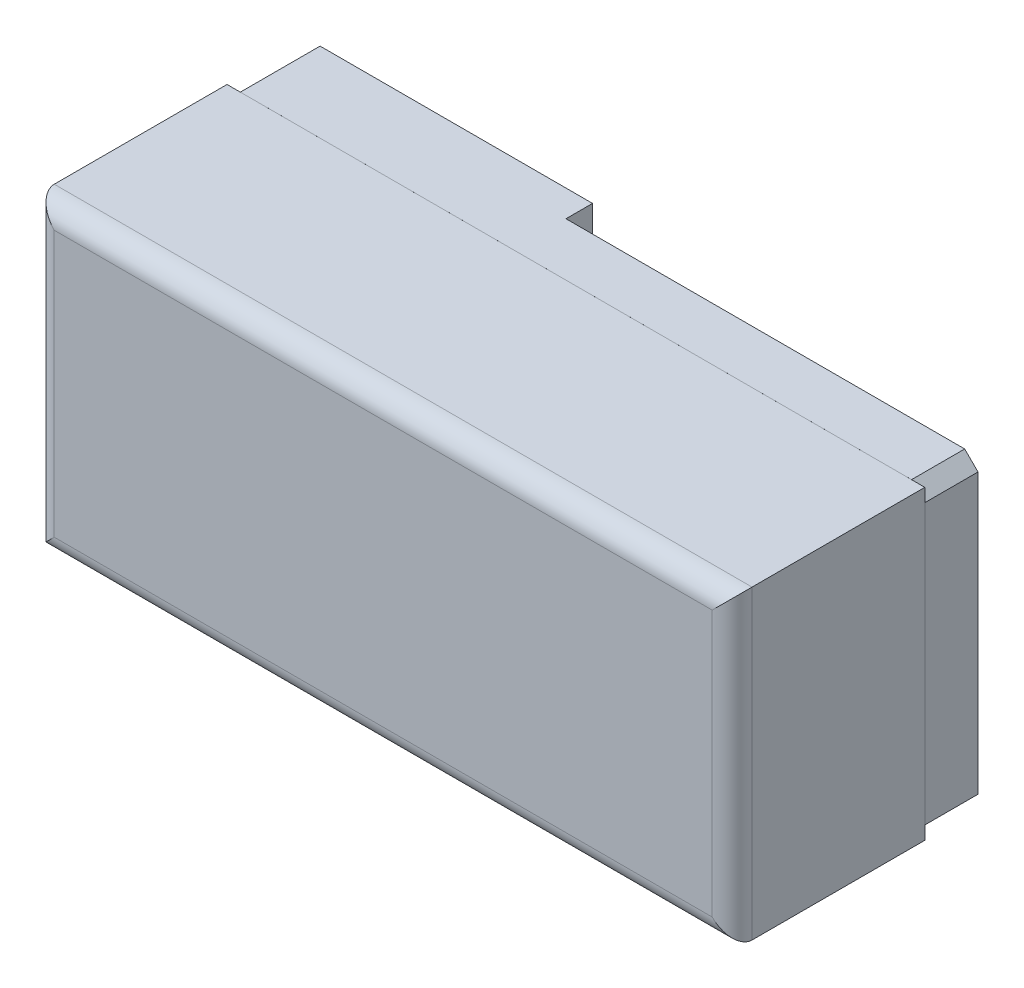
ISO-10303-21;
HEADER;
FILE_DESCRIPTION(('STEP AP214'),'2;1');
FILE_NAME('part.step','',(''),(''),'','','');
FILE_SCHEMA(('AUTOMOTIVE_DESIGN { 1 0 10303 214 1 1 1 1 }'));
ENDSEC;
DATA;
#1=APPLICATION_CONTEXT('core data for automotive mechanical design processes');
#2=APPLICATION_PROTOCOL_DEFINITION('international standard','automotive_design',2000,#1);
#3=PRODUCT_CONTEXT('',#1,'mechanical');
#4=PRODUCT('Part','Part','',(#3));
#5=PRODUCT_RELATED_PRODUCT_CATEGORY('part','',(#4));
#6=PRODUCT_DEFINITION_FORMATION('','',#4);
#7=PRODUCT_DEFINITION_CONTEXT('part definition',#1,'design');
#8=PRODUCT_DEFINITION('design','',#6,#7);
#9=PRODUCT_DEFINITION_SHAPE('','',#8);
#10=(LENGTH_UNIT() NAMED_UNIT(*) SI_UNIT(.MILLI.,.METRE.));
#11=(NAMED_UNIT(*) PLANE_ANGLE_UNIT() SI_UNIT($,.RADIAN.));
#12=(NAMED_UNIT(*) SI_UNIT($,.STERADIAN.) SOLID_ANGLE_UNIT());
#13=UNCERTAINTY_MEASURE_WITH_UNIT(LENGTH_MEASURE(1.E-05),#10,'distance_accuracy_value','');
#14=(GEOMETRIC_REPRESENTATION_CONTEXT(3) GLOBAL_UNCERTAINTY_ASSIGNED_CONTEXT((#13)) GLOBAL_UNIT_ASSIGNED_CONTEXT((#10,
#11,#12)) REPRESENTATION_CONTEXT('',''));
#15=CARTESIAN_POINT('',(0.,0.,0.));
#16=DIRECTION('',(0.,0.,1.));
#17=DIRECTION('',(1.,0.,0.));
#18=AXIS2_PLACEMENT_3D('',#15,#16,#17);
#19=CARTESIAN_POINT('',(52.5,-23.,12.));
#20=DIRECTION('',(-1.,0.,0.));
#21=DIRECTION('',(0.,0.,1.));
#22=AXIS2_PLACEMENT_3D('',#19,#20,#21);
#23=PLANE('',#22);
#24=DIRECTION('',(0.,-1.,0.));
#25=VECTOR('',#24,1.);
#26=CARTESIAN_POINT('',(52.5,-23.,12.001));
#27=LINE('',#26,#25);
#28=CARTESIAN_POINT('',(52.5,23.,12.001));
#29=VERTEX_POINT('',#28);
#30=CARTESIAN_POINT('',(52.5,-23.,12.001));
#31=VERTEX_POINT('',#30);
#32=EDGE_CURVE('E89',#29,#31,#27,.T.);
#33=ORIENTED_EDGE('',*,*,#32,.F.);
#34=DIRECTION('',(0.,0.,-1.));
#35=VECTOR('',#34,1.);
#36=CARTESIAN_POINT('',(52.5,23.,41.));
#37=LINE('',#36,#35);
#38=CARTESIAN_POINT('',(52.5,23.,38.));
#39=VERTEX_POINT('',#38);
#40=EDGE_CURVE('E135',#39,#29,#37,.T.);
#41=ORIENTED_EDGE('',*,*,#40,.F.);
#42=DIRECTION('',(0.,1.,0.));
#43=VECTOR('',#42,1.);
#44=CARTESIAN_POINT('',(52.5,-23.,38.));
#45=LINE('',#44,#43);
#46=CARTESIAN_POINT('',(52.5,-23.,38.));
#47=VERTEX_POINT('',#46);
#48=EDGE_CURVE('E130',#39,#47,#45,.F.);
#49=ORIENTED_EDGE('',*,*,#48,.T.);
#50=DIRECTION('',(0.,0.,-1.));
#51=VECTOR('',#50,1.);
#52=CARTESIAN_POINT('',(52.5,-23.,41.));
#53=LINE('',#52,#51);
#54=EDGE_CURVE('E132',#47,#31,#53,.T.);
#55=ORIENTED_EDGE('',*,*,#54,.T.);
#56=EDGE_LOOP('',(#33,#41,#49,#55));
#57=FACE_BOUND('',#56,.T.);
#58=ADVANCED_FACE('F46',(#57),#23,.F.);
#59=CARTESIAN_POINT('',(-52.5,23.,12.));
#60=DIRECTION('',(0.,-1.,0.));
#61=DIRECTION('',(1.,0.,0.));
#62=AXIS2_PLACEMENT_3D('',#59,#60,#61);
#63=PLANE('',#62);
#64=DIRECTION('',(1.,0.,0.));
#65=VECTOR('',#64,1.);
#66=CARTESIAN_POINT('',(-52.5,23.,12.001));
#67=LINE('',#66,#65);
#68=CARTESIAN_POINT('',(-52.5,23.,12.001));
#69=VERTEX_POINT('',#68);
#70=EDGE_CURVE('E12',#69,#29,#67,.T.);
#71=ORIENTED_EDGE('',*,*,#70,.F.);
#72=DIRECTION('',(0.,0.,-1.));
#73=VECTOR('',#72,1.);
#74=CARTESIAN_POINT('',(-52.5,23.,41.));
#75=LINE('',#74,#73);
#76=CARTESIAN_POINT('',(-52.5,23.,38.));
#77=VERTEX_POINT('',#76);
#78=EDGE_CURVE('E107',#77,#69,#75,.T.);
#79=ORIENTED_EDGE('',*,*,#78,.F.);
#80=DIRECTION('',(-1.,0.,0.));
#81=VECTOR('',#80,1.);
#82=CARTESIAN_POINT('',(-52.5,23.,38.));
#83=LINE('',#82,#81);
#84=EDGE_CURVE('E133',#77,#39,#83,.F.);
#85=ORIENTED_EDGE('',*,*,#84,.T.);
#86=ORIENTED_EDGE('',*,*,#40,.T.);
#87=EDGE_LOOP('',(#71,#79,#85,#86));
#88=FACE_BOUND('',#87,.T.);
#89=ADVANCED_FACE('F148',(#88),#63,.F.);
#90=CARTESIAN_POINT('',(-52.5,-23.,12.));
#91=DIRECTION('',(1.,0.,0.));
#92=DIRECTION('',(0.,0.,-1.));
#93=AXIS2_PLACEMENT_3D('',#90,#91,#92);
#94=PLANE('',#93);
#95=DIRECTION('',(0.,1.,0.));
#96=VECTOR('',#95,1.);
#97=CARTESIAN_POINT('',(-52.5,-23.,12.001));
#98=LINE('',#97,#96);
#99=CARTESIAN_POINT('',(-52.5,-23.,12.001));
#100=VERTEX_POINT('',#99);
#101=EDGE_CURVE('E49',#100,#69,#98,.T.);
#102=ORIENTED_EDGE('',*,*,#101,.F.);
#103=DIRECTION('',(0.,0.,-1.));
#104=VECTOR('',#103,1.);
#105=CARTESIAN_POINT('',(-52.5,-23.,41.));
#106=LINE('',#105,#104);
#107=CARTESIAN_POINT('',(-52.5,-23.,38.));
#108=VERTEX_POINT('',#107);
#109=EDGE_CURVE('E104',#108,#100,#106,.T.);
#110=ORIENTED_EDGE('',*,*,#109,.F.);
#111=DIRECTION('',(0.,-1.,0.));
#112=VECTOR('',#111,1.);
#113=CARTESIAN_POINT('',(-52.5,-23.,38.));
#114=LINE('',#113,#112);
#115=EDGE_CURVE('E136',#108,#77,#114,.F.);
#116=ORIENTED_EDGE('',*,*,#115,.T.);
#117=ORIENTED_EDGE('',*,*,#78,.T.);
#118=EDGE_LOOP('',(#102,#110,#116,#117));
#119=FACE_BOUND('',#118,.T.);
#120=ADVANCED_FACE('F102',(#119),#94,.F.);
#121=CARTESIAN_POINT('',(-52.5,-23.,12.));
#122=DIRECTION('',(0.,1.,0.));
#123=DIRECTION('',(-1.,0.,0.));
#124=AXIS2_PLACEMENT_3D('',#121,#122,#123);
#125=PLANE('',#124);
#126=DIRECTION('',(-1.,0.,0.));
#127=VECTOR('',#126,1.);
#128=CARTESIAN_POINT('',(-52.5,-23.,12.001));
#129=LINE('',#128,#127);
#130=EDGE_CURVE('E91',#31,#100,#129,.T.);
#131=ORIENTED_EDGE('',*,*,#130,.F.);
#132=ORIENTED_EDGE('',*,*,#54,.F.);
#133=DIRECTION('',(1.,0.,0.));
#134=VECTOR('',#133,1.);
#135=CARTESIAN_POINT('',(-52.5,-23.,38.));
#136=LINE('',#135,#134);
#137=EDGE_CURVE('E110',#47,#108,#136,.F.);
#138=ORIENTED_EDGE('',*,*,#137,.T.);
#139=ORIENTED_EDGE('',*,*,#109,.T.);
#140=EDGE_LOOP('',(#131,#132,#138,#139));
#141=FACE_BOUND('',#140,.T.);
#142=ADVANCED_FACE('F108',(#141),#125,.F.);
#143=CARTESIAN_POINT('',(0.,0.,41.));
#144=DIRECTION('',(0.,0.,-1.));
#145=DIRECTION('',(-1.,0.,0.));
#146=AXIS2_PLACEMENT_3D('',#143,#144,#145);
#147=PLANE('',#146);
#148=DIRECTION('',(-1.,0.,0.));
#149=VECTOR('',#148,1.);
#150=CARTESIAN_POINT('',(0.,20.,41.));
#151=LINE('',#150,#149);
#152=CARTESIAN_POINT('',(49.5,20.,41.));
#153=VERTEX_POINT('',#152);
#154=CARTESIAN_POINT('',(-49.5,20.,41.));
#155=VERTEX_POINT('',#154);
#156=EDGE_CURVE('E111',#153,#155,#151,.T.);
#157=ORIENTED_EDGE('',*,*,#156,.T.);
#158=DIRECTION('',(0.,-1.,0.));
#159=VECTOR('',#158,1.);
#160=CARTESIAN_POINT('',(-49.5,0.,41.));
#161=LINE('',#160,#159);
#162=CARTESIAN_POINT('',(-49.5,-20.,41.));
#163=VERTEX_POINT('',#162);
#164=EDGE_CURVE('E113',#155,#163,#161,.T.);
#165=ORIENTED_EDGE('',*,*,#164,.T.);
#166=DIRECTION('',(1.,0.,0.));
#167=VECTOR('',#166,1.);
#168=CARTESIAN_POINT('',(0.,-20.,41.));
#169=LINE('',#168,#167);
#170=CARTESIAN_POINT('',(49.5,-20.,41.));
#171=VERTEX_POINT('',#170);
#172=EDGE_CURVE('E139',#163,#171,#169,.T.);
#173=ORIENTED_EDGE('',*,*,#172,.T.);
#174=DIRECTION('',(0.,1.,0.));
#175=VECTOR('',#174,1.);
#176=CARTESIAN_POINT('',(49.5,0.,41.));
#177=LINE('',#176,#175);
#178=EDGE_CURVE('E141',#171,#153,#177,.T.);
#179=ORIENTED_EDGE('',*,*,#178,.T.);
#180=EDGE_LOOP('',(#157,#165,#173,#179));
#181=FACE_BOUND('',#180,.T.);
#182=ADVANCED_FACE('F167',(#181),#147,.F.);
#183=CARTESIAN_POINT('',(49.5,0.,38.));
#184=DIRECTION('',(0.,1.,0.));
#185=DIRECTION('',(0.,0.,1.));
#186=AXIS2_PLACEMENT_3D('',#183,#184,#185);
#187=CYLINDRICAL_SURFACE('',#186,3.);
#188=CARTESIAN_POINT('',(49.5,-20.,38.));
#189=DIRECTION('',(0.707106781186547,0.707106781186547,0.));
#190=DIRECTION('',(0.707106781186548,-0.707106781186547,0.));
#191=AXIS2_PLACEMENT_3D('',#188,#189,#190);
#192=ELLIPSE('',#191,4.24264068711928,3.);
#193=EDGE_CURVE('E126',#47,#171,#192,.F.);
#194=ORIENTED_EDGE('',*,*,#193,.F.);
#195=ORIENTED_EDGE('',*,*,#48,.F.);
#196=CARTESIAN_POINT('',(49.5,20.,38.));
#197=DIRECTION('',(-0.707106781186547,0.707106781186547,0.));
#198=DIRECTION('',(0.707106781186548,0.707106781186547,0.));
#199=AXIS2_PLACEMENT_3D('',#196,#197,#198);
#200=ELLIPSE('',#199,4.24264068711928,3.);
#201=EDGE_CURVE('E143',#153,#39,#200,.T.);
#202=ORIENTED_EDGE('',*,*,#201,.F.);
#203=ORIENTED_EDGE('',*,*,#178,.F.);
#204=EDGE_LOOP('',(#194,#195,#202,#203));
#205=FACE_BOUND('',#204,.T.);
#206=ADVANCED_FACE('F156',(#205),#187,.T.);
#207=CARTESIAN_POINT('',(0.,20.,38.));
#208=DIRECTION('',(-1.,0.,0.));
#209=DIRECTION('',(0.,-1.,0.));
#210=AXIS2_PLACEMENT_3D('',#207,#208,#209);
#211=CYLINDRICAL_SURFACE('',#210,3.);
#212=ORIENTED_EDGE('',*,*,#201,.T.);
#213=ORIENTED_EDGE('',*,*,#84,.F.);
#214=CARTESIAN_POINT('',(-49.5,20.,38.));
#215=DIRECTION('',(-0.707106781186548,-0.707106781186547,0.));
#216=DIRECTION('',(-0.707106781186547,0.707106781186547,0.));
#217=AXIS2_PLACEMENT_3D('',#214,#215,#216);
#218=ELLIPSE('',#217,4.24264068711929,3.);
#219=EDGE_CURVE('E120',#155,#77,#218,.T.);
#220=ORIENTED_EDGE('',*,*,#219,.F.);
#221=ORIENTED_EDGE('',*,*,#156,.F.);
#222=EDGE_LOOP('',(#212,#213,#220,#221));
#223=FACE_BOUND('',#222,.T.);
#224=ADVANCED_FACE('F161',(#223),#211,.T.);
#225=CARTESIAN_POINT('',(0.,-20.,38.));
#226=DIRECTION('',(1.,0.,0.));
#227=DIRECTION('',(0.,1.,0.));
#228=AXIS2_PLACEMENT_3D('',#225,#226,#227);
#229=CYLINDRICAL_SURFACE('',#228,3.);
#230=ORIENTED_EDGE('',*,*,#193,.T.);
#231=ORIENTED_EDGE('',*,*,#172,.F.);
#232=CARTESIAN_POINT('',(-49.5,-20.,38.));
#233=DIRECTION('',(0.707106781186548,-0.707106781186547,0.));
#234=DIRECTION('',(0.707106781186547,0.707106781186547,0.));
#235=AXIS2_PLACEMENT_3D('',#232,#233,#234);
#236=ELLIPSE('',#235,4.24264068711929,3.);
#237=EDGE_CURVE('E119',#108,#163,#236,.F.);
#238=ORIENTED_EDGE('',*,*,#237,.F.);
#239=ORIENTED_EDGE('',*,*,#137,.F.);
#240=EDGE_LOOP('',(#230,#231,#238,#239));
#241=FACE_BOUND('',#240,.T.);
#242=ADVANCED_FACE('F165',(#241),#229,.T.);
#243=CARTESIAN_POINT('',(-49.5,0.,38.));
#244=DIRECTION('',(0.,-1.,0.));
#245=DIRECTION('',(0.,0.,-1.));
#246=AXIS2_PLACEMENT_3D('',#243,#244,#245);
#247=CYLINDRICAL_SURFACE('',#246,3.);
#248=ORIENTED_EDGE('',*,*,#219,.T.);
#249=ORIENTED_EDGE('',*,*,#115,.F.);
#250=ORIENTED_EDGE('',*,*,#237,.T.);
#251=ORIENTED_EDGE('',*,*,#164,.F.);
#252=EDGE_LOOP('',(#248,#249,#250,#251));
#253=FACE_BOUND('',#252,.T.);
#254=ADVANCED_FACE('F168',(#253),#247,.T.);
#255=CARTESIAN_POINT('',(0.,0.,12.001));
#256=DIRECTION('',(0.,0.,-1.));
#257=DIRECTION('',(-1.,0.,0.));
#258=AXIS2_PLACEMENT_3D('',#255,#256,#257);
#259=PLANE('',#258);
#260=ORIENTED_EDGE('',*,*,#32,.T.);
#261=ORIENTED_EDGE('',*,*,#130,.T.);
#262=ORIENTED_EDGE('',*,*,#101,.T.);
#263=ORIENTED_EDGE('',*,*,#70,.T.);
#264=EDGE_LOOP('',(#260,#261,#262,#263));
#265=FACE_BOUND('',#264,.T.);
#266=ADVANCED_FACE('F93',(#265),#259,.T.);
#267=CLOSED_SHELL('',(#58,#89,#120,#142,#182,#206,#224,#242,#254,#266));
#268=MANIFOLD_SOLID_BREP('B2',#267);
#269=CARTESIAN_POINT('',(22.,-5.,-8.));
#270=DIRECTION('',(0.,-1.,0.));
#271=DIRECTION('',(0.,0.,-1.));
#272=AXIS2_PLACEMENT_3D('',#269,#270,#271);
#273=PLANE('',#272);
#274=DIRECTION('',(1.,0.,0.));
#275=VECTOR('',#274,1.);
#276=CARTESIAN_POINT('',(22.,-5.,4.));
#277=LINE('',#276,#275);
#278=CARTESIAN_POINT('',(22.,-5.,4.));
#279=VERTEX_POINT('',#278);
#280=CARTESIAN_POINT('',(32.,-5.,4.));
#281=VERTEX_POINT('',#280);
#282=EDGE_CURVE('E487',#279,#281,#277,.T.);
#283=ORIENTED_EDGE('',*,*,#282,.F.);
#284=DIRECTION('',(0.,0.,1.));
#285=VECTOR('',#284,1.);
#286=CARTESIAN_POINT('',(22.,-5.,-8.));
#287=LINE('',#286,#285);
#288=CARTESIAN_POINT('',(22.,-5.,12.));
#289=VERTEX_POINT('',#288);
#290=EDGE_CURVE('E450',#279,#289,#287,.T.);
#291=ORIENTED_EDGE('',*,*,#290,.T.);
#292=DIRECTION('',(1.,0.,0.));
#293=VECTOR('',#292,1.);
#294=CARTESIAN_POINT('',(22.,-5.,12.));
#295=LINE('',#294,#293);
#296=CARTESIAN_POINT('',(32.,-5.,12.));
#297=VERTEX_POINT('',#296);
#298=EDGE_CURVE('E467',#289,#297,#295,.T.);
#299=ORIENTED_EDGE('',*,*,#298,.T.);
#300=DIRECTION('',(0.,0.,1.));
#301=VECTOR('',#300,1.);
#302=CARTESIAN_POINT('',(32.,-5.,-8.));
#303=LINE('',#302,#301);
#304=EDGE_CURVE('E453',#281,#297,#303,.T.);
#305=ORIENTED_EDGE('',*,*,#304,.F.);
#306=EDGE_LOOP('',(#283,#291,#299,#305));
#307=FACE_BOUND('',#306,.T.);
#308=ADVANCED_FACE('F261',(#307),#273,.F.);
#309=CARTESIAN_POINT('',(32.,0.,-8.));
#310=DIRECTION('',(0.,0.,1.));
#311=DIRECTION('',(1.,0.,0.));
#312=AXIS2_PLACEMENT_3D('',#309,#310,#311);
#313=CYLINDRICAL_SURFACE('',#312,5.);
#314=CARTESIAN_POINT('',(32.,0.,4.));
#315=DIRECTION('',(0.,0.,-1.));
#316=DIRECTION('',(-1.,0.,0.));
#317=AXIS2_PLACEMENT_3D('',#314,#315,#316);
#318=CIRCLE('',#317,5.);
#319=CARTESIAN_POINT('',(32.,5.,4.));
#320=VERTEX_POINT('',#319);
#321=EDGE_CURVE('E485',#281,#320,#318,.F.);
#322=ORIENTED_EDGE('',*,*,#321,.F.);
#323=ORIENTED_EDGE('',*,*,#304,.T.);
#324=CARTESIAN_POINT('',(32.,0.,12.));
#325=DIRECTION('',(0.,0.,1.));
#326=DIRECTION('',(1.,0.,0.));
#327=AXIS2_PLACEMENT_3D('',#324,#325,#326);
#328=CIRCLE('',#327,5.);
#329=CARTESIAN_POINT('',(32.,5.,12.));
#330=VERTEX_POINT('',#329);
#331=EDGE_CURVE('E464',#297,#330,#328,.T.);
#332=ORIENTED_EDGE('',*,*,#331,.T.);
#333=DIRECTION('',(0.,0.,1.));
#334=VECTOR('',#333,1.);
#335=CARTESIAN_POINT('',(32.,5.,-8.));
#336=LINE('',#335,#334);
#337=EDGE_CURVE('E457',#320,#330,#336,.T.);
#338=ORIENTED_EDGE('',*,*,#337,.F.);
#339=EDGE_LOOP('',(#322,#323,#332,#338));
#340=FACE_BOUND('',#339,.T.);
#341=ADVANCED_FACE('F564',(#340),#313,.F.);
#342=CARTESIAN_POINT('',(22.,5.,-8.));
#343=DIRECTION('',(0.,1.,0.));
#344=DIRECTION('',(0.,0.,1.));
#345=AXIS2_PLACEMENT_3D('',#342,#343,#344);
#346=PLANE('',#345);
#347=DIRECTION('',(-1.,0.,0.));
#348=VECTOR('',#347,1.);
#349=CARTESIAN_POINT('',(22.,5.,4.));
#350=LINE('',#349,#348);
#351=CARTESIAN_POINT('',(22.,5.,4.));
#352=VERTEX_POINT('',#351);
#353=EDGE_CURVE('E483',#320,#352,#350,.T.);
#354=ORIENTED_EDGE('',*,*,#353,.F.);
#355=ORIENTED_EDGE('',*,*,#337,.T.);
#356=DIRECTION('',(-1.,0.,0.));
#357=VECTOR('',#356,1.);
#358=CARTESIAN_POINT('',(22.,5.,12.));
#359=LINE('',#358,#357);
#360=CARTESIAN_POINT('',(22.,5.,12.));
#361=VERTEX_POINT('',#360);
#362=EDGE_CURVE('E454',#330,#361,#359,.T.);
#363=ORIENTED_EDGE('',*,*,#362,.T.);
#364=DIRECTION('',(0.,0.,1.));
#365=VECTOR('',#364,1.);
#366=CARTESIAN_POINT('',(22.,5.,-8.));
#367=LINE('',#366,#365);
#368=EDGE_CURVE('E445',#352,#361,#367,.T.);
#369=ORIENTED_EDGE('',*,*,#368,.F.);
#370=EDGE_LOOP('',(#354,#355,#363,#369));
#371=FACE_BOUND('',#370,.T.);
#372=ADVANCED_FACE('F570',(#371),#346,.F.);
#373=CARTESIAN_POINT('',(22.,0.,-8.));
#374=DIRECTION('',(0.,0.,1.));
#375=DIRECTION('',(1.,0.,0.));
#376=AXIS2_PLACEMENT_3D('',#373,#374,#375);
#377=CYLINDRICAL_SURFACE('',#376,5.);
#378=CARTESIAN_POINT('',(22.,0.,4.));
#379=DIRECTION('',(0.,0.,-1.));
#380=DIRECTION('',(-1.,0.,0.));
#381=AXIS2_PLACEMENT_3D('',#378,#379,#380);
#382=CIRCLE('',#381,5.);
#383=EDGE_CURVE('E278',#352,#279,#382,.F.);
#384=ORIENTED_EDGE('',*,*,#383,.F.);
#385=ORIENTED_EDGE('',*,*,#368,.T.);
#386=CARTESIAN_POINT('',(22.,0.,12.));
#387=DIRECTION('',(0.,0.,1.));
#388=DIRECTION('',(1.,0.,0.));
#389=AXIS2_PLACEMENT_3D('',#386,#387,#388);
#390=CIRCLE('',#389,5.);
#391=EDGE_CURVE('E470',#361,#289,#390,.T.);
#392=ORIENTED_EDGE('',*,*,#391,.T.);
#393=ORIENTED_EDGE('',*,*,#290,.F.);
#394=EDGE_LOOP('',(#384,#385,#392,#393));
#395=FACE_BOUND('',#394,.T.);
#396=ADVANCED_FACE('F575',(#395),#377,.F.);
#397=CARTESIAN_POINT('',(43.5,0.,12.));
#398=DIRECTION('',(0.,0.,1.));
#399=DIRECTION('',(1.,0.,0.));
#400=AXIS2_PLACEMENT_3D('',#397,#398,#399);
#401=CYLINDRICAL_SURFACE('',#400,1.64999999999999);
#402=CARTESIAN_POINT('',(43.5,0.,12.));
#403=DIRECTION('',(0.,0.,-1.));
#404=DIRECTION('',(-1.,0.,0.));
#405=AXIS2_PLACEMENT_3D('',#402,#403,#404);
#406=CIRCLE('',#405,1.64999999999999);
#407=CARTESIAN_POINT('',(41.85,0.,12.));
#408=VERTEX_POINT('',#407);
#409=EDGE_CURVE('E503',#408,#408,#406,.F.);
#410=ORIENTED_EDGE('',*,*,#409,.T.);
#411=EDGE_LOOP('',(#410));
#412=FACE_BOUND('',#411,.T.);
#413=CARTESIAN_POINT('',(43.5,0.,4.));
#414=DIRECTION('',(0.,0.,-1.));
#415=DIRECTION('',(-1.,0.,0.));
#416=AXIS2_PLACEMENT_3D('',#413,#414,#415);
#417=CIRCLE('',#416,1.64999999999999);
#418=CARTESIAN_POINT('',(41.85,0.,4.));
#419=VERTEX_POINT('',#418);
#420=EDGE_CURVE('E489',#419,#419,#417,.F.);
#421=ORIENTED_EDGE('',*,*,#420,.F.);
#422=EDGE_LOOP('',(#421));
#423=FACE_BOUND('',#422,.T.);
#424=ADVANCED_FACE('F578',(#412,#423),#401,.F.);
#425=CARTESIAN_POINT('',(75.4224935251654,-32.4777737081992,4.));
#426=DIRECTION('',(0.,0.,-1.));
#427=DIRECTION('',(-1.,0.,0.));
#428=AXIS2_PLACEMENT_3D('',#425,#426,#427);
#429=PLANE('',#428);
#430=ORIENTED_EDGE('',*,*,#420,.T.);
#431=EDGE_LOOP('',(#430));
#432=FACE_BOUND('',#431,.T.);
#433=DIRECTION('',(-1.,0.,0.));
#434=VECTOR('',#433,1.);
#435=CARTESIAN_POINT('',(-52.5,-23.,4.));
#436=LINE('',#435,#434);
#437=CARTESIAN_POINT('',(50.5,-23.,4.));
#438=VERTEX_POINT('',#437);
#439=CARTESIAN_POINT('',(-9.50000000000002,-23.,4.));
#440=VERTEX_POINT('',#439);
#441=EDGE_CURVE('E492',#438,#440,#436,.T.);
#442=ORIENTED_EDGE('',*,*,#441,.T.);
#443=DIRECTION('',(0.,1.,0.));
#444=VECTOR('',#443,1.);
#445=CARTESIAN_POINT('',(-9.50000000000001,37.1626767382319,4.));
#446=LINE('',#445,#444);
#447=CARTESIAN_POINT('',(-9.50000000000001,23.,4.));
#448=VERTEX_POINT('',#447);
#449=EDGE_CURVE('E500',#440,#448,#446,.T.);
#450=ORIENTED_EDGE('',*,*,#449,.T.);
#451=DIRECTION('',(1.,0.,0.));
#452=VECTOR('',#451,1.);
#453=CARTESIAN_POINT('',(-52.5,23.,4.));
#454=LINE('',#453,#452);
#455=CARTESIAN_POINT('',(50.5,23.,4.));
#456=VERTEX_POINT('',#455);
#457=EDGE_CURVE('E286',#448,#456,#454,.T.);
#458=ORIENTED_EDGE('',*,*,#457,.T.);
#459=DIRECTION('',(0.707106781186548,-0.707106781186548,0.));
#460=VECTOR('',#459,1.);
#461=CARTESIAN_POINT('',(50.5,23.,4.));
#462=LINE('',#461,#460);
#463=CARTESIAN_POINT('',(52.5,21.,4.));
#464=VERTEX_POINT('',#463);
#465=EDGE_CURVE('E44',#464,#456,#462,.F.);
#466=ORIENTED_EDGE('',*,*,#465,.F.);
#467=DIRECTION('',(0.,-1.,0.));
#468=VECTOR('',#467,1.);
#469=CARTESIAN_POINT('',(52.5,-23.,4.));
#470=LINE('',#469,#468);
#471=CARTESIAN_POINT('',(52.5,-21.,4.));
#472=VERTEX_POINT('',#471);
#473=EDGE_CURVE('E497',#464,#472,#470,.T.);
#474=ORIENTED_EDGE('',*,*,#473,.T.);
#475=DIRECTION('',(-0.707106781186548,-0.707106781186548,0.));
#476=VECTOR('',#475,1.);
#477=CARTESIAN_POINT('',(52.5,-21.,4.));
#478=LINE('',#477,#476);
#479=EDGE_CURVE('E494',#438,#472,#478,.F.);
#480=ORIENTED_EDGE('',*,*,#479,.F.);
#481=EDGE_LOOP('',(#442,#450,#458,#466,#474,#480));
#482=FACE_BOUND('',#481,.T.);
#483=ORIENTED_EDGE('',*,*,#383,.T.);
#484=ORIENTED_EDGE('',*,*,#282,.T.);
#485=ORIENTED_EDGE('',*,*,#321,.T.);
#486=ORIENTED_EDGE('',*,*,#353,.T.);
#487=EDGE_LOOP('',(#483,#484,#485,#486));
#488=FACE_BOUND('',#487,.T.);
#489=ADVANCED_FACE('F536',(#432,#482,#488),#429,.T.);
#490=CARTESIAN_POINT('',(-9.50000000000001,37.1626767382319,4.));
#491=DIRECTION('',(-1.,0.,0.));
#492=DIRECTION('',(0.,-1.,0.));
#493=AXIS2_PLACEMENT_3D('',#490,#491,#492);
#494=PLANE('',#493);
#495=ORIENTED_EDGE('',*,*,#449,.F.);
#496=DIRECTION('',(0.,0.,1.));
#497=VECTOR('',#496,1.);
#498=CARTESIAN_POINT('',(-9.50000000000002,-23.,12.));
#499=LINE('',#498,#497);
#500=CARTESIAN_POINT('',(-9.50000000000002,-23.,0.));
#501=VERTEX_POINT('',#500);
#502=EDGE_CURVE('E479',#501,#440,#499,.T.);
#503=ORIENTED_EDGE('',*,*,#502,.F.);
#504=DIRECTION('',(0.,1.,0.));
#505=VECTOR('',#504,1.);
#506=CARTESIAN_POINT('',(-9.50000000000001,37.1626767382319,0.));
#507=LINE('',#506,#505);
#508=CARTESIAN_POINT('',(-9.50000000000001,23.,0.));
#509=VERTEX_POINT('',#508);
#510=EDGE_CURVE('E501',#501,#509,#507,.T.);
#511=ORIENTED_EDGE('',*,*,#510,.T.);
#512=DIRECTION('',(0.,0.,-1.));
#513=VECTOR('',#512,1.);
#514=CARTESIAN_POINT('',(-9.50000000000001,23.,12.));
#515=LINE('',#514,#513);
#516=EDGE_CURVE('E476',#448,#509,#515,.T.);
#517=ORIENTED_EDGE('',*,*,#516,.F.);
#518=EDGE_LOOP('',(#495,#503,#511,#517));
#519=FACE_BOUND('',#518,.T.);
#520=ADVANCED_FACE('F535',(#519),#494,.F.);
#521=CARTESIAN_POINT('',(-31.5,0.,-8.));
#522=DIRECTION('',(0.,0.,1.));
#523=DIRECTION('',(1.,0.,0.));
#524=AXIS2_PLACEMENT_3D('',#521,#522,#523);
#525=CYLINDRICAL_SURFACE('',#524,8.);
#526=CARTESIAN_POINT('',(-31.5,0.,0.));
#527=DIRECTION('',(0.,0.,-1.));
#528=DIRECTION('',(-1.,0.,0.));
#529=AXIS2_PLACEMENT_3D('',#526,#527,#528);
#530=CIRCLE('',#529,8.);
#531=CARTESIAN_POINT('',(-39.5,0.,0.));
#532=VERTEX_POINT('',#531);
#533=EDGE_CURVE('E441',#532,#532,#530,.T.);
#534=ORIENTED_EDGE('',*,*,#533,.T.);
#535=EDGE_LOOP('',(#534));
#536=FACE_BOUND('',#535,.T.);
#537=CARTESIAN_POINT('',(-31.5,0.,12.));
#538=DIRECTION('',(0.,0.,-1.));
#539=DIRECTION('',(-1.,0.,0.));
#540=AXIS2_PLACEMENT_3D('',#537,#538,#539);
#541=CIRCLE('',#540,8.);
#542=CARTESIAN_POINT('',(-39.5,0.,12.));
#543=VERTEX_POINT('',#542);
#544=EDGE_CURVE('E507',#543,#543,#541,.F.);
#545=ORIENTED_EDGE('',*,*,#544,.T.);
#546=EDGE_LOOP('',(#545));
#547=FACE_BOUND('',#546,.T.);
#548=ADVANCED_FACE('F580',(#536,#547),#525,.F.);
#549=CARTESIAN_POINT('',(-14.5,0.,12.));
#550=DIRECTION('',(0.,0.,1.));
#551=DIRECTION('',(1.,0.,0.));
#552=AXIS2_PLACEMENT_3D('',#549,#550,#551);
#553=CYLINDRICAL_SURFACE('',#552,1.64999999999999);
#554=CARTESIAN_POINT('',(-14.5,0.,0.));
#555=DIRECTION('',(0.,0.,1.));
#556=DIRECTION('',(1.,0.,0.));
#557=AXIS2_PLACEMENT_3D('',#554,#555,#556);
#558=CIRCLE('',#557,1.65);
#559=CARTESIAN_POINT('',(-12.85,0.,0.));
#560=VERTEX_POINT('',#559);
#561=EDGE_CURVE('E473',#560,#560,#558,.T.);
#562=ORIENTED_EDGE('',*,*,#561,.F.);
#563=EDGE_LOOP('',(#562));
#564=FACE_BOUND('',#563,.T.);
#565=CARTESIAN_POINT('',(-14.5,0.,12.));
#566=DIRECTION('',(0.,0.,-1.));
#567=DIRECTION('',(-1.,0.,0.));
#568=AXIS2_PLACEMENT_3D('',#565,#566,#567);
#569=CIRCLE('',#568,1.64999999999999);
#570=CARTESIAN_POINT('',(-16.15,0.,12.));
#571=VERTEX_POINT('',#570);
#572=EDGE_CURVE('E387',#571,#571,#569,.F.);
#573=ORIENTED_EDGE('',*,*,#572,.T.);
#574=EDGE_LOOP('',(#573));
#575=FACE_BOUND('',#574,.T.);
#576=ADVANCED_FACE('F583',(#564,#575),#553,.F.);
#577=CARTESIAN_POINT('',(52.5,23.,0.));
#578=DIRECTION('',(0.,0.,-1.));
#579=DIRECTION('',(-1.,0.,0.));
#580=AXIS2_PLACEMENT_3D('',#577,#578,#579);
#581=PLANE('',#580);
#582=ORIENTED_EDGE('',*,*,#510,.F.);
#583=DIRECTION('',(1.,0.,0.));
#584=VECTOR('',#583,1.);
#585=CARTESIAN_POINT('',(-52.5,-23.,0.));
#586=LINE('',#585,#584);
#587=CARTESIAN_POINT('',(-50.5,-23.,0.));
#588=VERTEX_POINT('',#587);
#589=EDGE_CURVE('E425',#588,#501,#586,.T.);
#590=ORIENTED_EDGE('',*,*,#589,.F.);
#591=DIRECTION('',(0.707106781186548,-0.707106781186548,0.));
#592=VECTOR('',#591,1.);
#593=CARTESIAN_POINT('',(-22.,-51.5,0.));
#594=LINE('',#593,#592);
#595=CARTESIAN_POINT('',(-52.5,-21.,0.));
#596=VERTEX_POINT('',#595);
#597=EDGE_CURVE('E393',#588,#596,#594,.F.);
#598=ORIENTED_EDGE('',*,*,#597,.T.);
#599=DIRECTION('',(0.,-1.,0.));
#600=VECTOR('',#599,1.);
#601=CARTESIAN_POINT('',(-52.5,-23.,0.));
#602=LINE('',#601,#600);
#603=CARTESIAN_POINT('',(-52.5,21.,0.));
#604=VERTEX_POINT('',#603);
#605=EDGE_CURVE('E447',#604,#596,#602,.T.);
#606=ORIENTED_EDGE('',*,*,#605,.F.);
#607=DIRECTION('',(-0.707106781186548,-0.707106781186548,0.));
#608=VECTOR('',#607,1.);
#609=CARTESIAN_POINT('',(1.,74.5,0.));
#610=LINE('',#609,#608);
#611=CARTESIAN_POINT('',(-50.5,23.,0.));
#612=VERTEX_POINT('',#611);
#613=EDGE_CURVE('E392',#604,#612,#610,.F.);
#614=ORIENTED_EDGE('',*,*,#613,.T.);
#615=DIRECTION('',(-1.,0.,0.));
#616=VECTOR('',#615,1.);
#617=CARTESIAN_POINT('',(-52.5,23.,0.));
#618=LINE('',#617,#616);
#619=EDGE_CURVE('E444',#509,#612,#618,.T.);
#620=ORIENTED_EDGE('',*,*,#619,.F.);
#621=EDGE_LOOP('',(#582,#590,#598,#606,#614,#620));
#622=FACE_BOUND('',#621,.T.);
#623=ORIENTED_EDGE('',*,*,#561,.T.);
#624=EDGE_LOOP('',(#623));
#625=FACE_BOUND('',#624,.T.);
#626=ORIENTED_EDGE('',*,*,#533,.F.);
#627=EDGE_LOOP('',(#626));
#628=FACE_BOUND('',#627,.T.);
#629=ADVANCED_FACE('F531',(#622,#625,#628),#581,.T.);
#630=CARTESIAN_POINT('',(-52.5,21.,12.));
#631=DIRECTION('',(0.707106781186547,-0.707106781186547,0.));
#632=DIRECTION('',(0.707106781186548,0.707106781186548,0.));
#633=AXIS2_PLACEMENT_3D('',#630,#631,#632);
#634=PLANE('',#633);
#635=DIRECTION('',(0.707106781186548,0.707106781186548,0.));
#636=VECTOR('',#635,1.);
#637=CARTESIAN_POINT('',(-52.5,21.,12.));
#638=LINE('',#637,#636);
#639=CARTESIAN_POINT('',(-50.5,23.,12.));
#640=VERTEX_POINT('',#639);
#641=CARTESIAN_POINT('',(-52.5,21.,12.));
#642=VERTEX_POINT('',#641);
#643=EDGE_CURVE('E363',#640,#642,#638,.F.);
#644=ORIENTED_EDGE('',*,*,#643,.F.);
#645=DIRECTION('',(0.,0.,1.));
#646=VECTOR('',#645,1.);
#647=CARTESIAN_POINT('',(-50.5,23.,12.));
#648=LINE('',#647,#646);
#649=EDGE_CURVE('E270',#612,#640,#648,.T.);
#650=ORIENTED_EDGE('',*,*,#649,.F.);
#651=ORIENTED_EDGE('',*,*,#613,.F.);
#652=DIRECTION('',(0.,0.,-1.));
#653=VECTOR('',#652,1.);
#654=CARTESIAN_POINT('',(-52.5,21.,12.));
#655=LINE('',#654,#653);
#656=EDGE_CURVE('E382',#642,#604,#655,.T.);
#657=ORIENTED_EDGE('',*,*,#656,.F.);
#658=EDGE_LOOP('',(#644,#650,#651,#657));
#659=FACE_BOUND('',#658,.T.);
#660=ADVANCED_FACE('F390',(#659),#634,.F.);
#661=CARTESIAN_POINT('',(-50.5,-23.,12.));
#662=DIRECTION('',(0.707106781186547,0.707106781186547,0.));
#663=DIRECTION('',(-0.707106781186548,0.707106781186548,0.));
#664=AXIS2_PLACEMENT_3D('',#661,#662,#663);
#665=PLANE('',#664);
#666=DIRECTION('',(-0.707106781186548,0.707106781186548,0.));
#667=VECTOR('',#666,1.);
#668=CARTESIAN_POINT('',(-50.5,-23.,12.));
#669=LINE('',#668,#667);
#670=CARTESIAN_POINT('',(-52.5,-21.,12.));
#671=VERTEX_POINT('',#670);
#672=CARTESIAN_POINT('',(-50.5,-23.,12.));
#673=VERTEX_POINT('',#672);
#674=EDGE_CURVE('E411',#671,#673,#669,.F.);
#675=ORIENTED_EDGE('',*,*,#674,.F.);
#676=DIRECTION('',(0.,0.,1.));
#677=VECTOR('',#676,1.);
#678=CARTESIAN_POINT('',(-52.5,-21.,12.));
#679=LINE('',#678,#677);
#680=EDGE_CURVE('E385',#596,#671,#679,.T.);
#681=ORIENTED_EDGE('',*,*,#680,.F.);
#682=ORIENTED_EDGE('',*,*,#597,.F.);
#683=DIRECTION('',(0.,0.,-1.));
#684=VECTOR('',#683,1.);
#685=CARTESIAN_POINT('',(-50.5,-23.,12.));
#686=LINE('',#685,#684);
#687=EDGE_CURVE('E424',#673,#588,#686,.T.);
#688=ORIENTED_EDGE('',*,*,#687,.F.);
#689=EDGE_LOOP('',(#675,#681,#682,#688));
#690=FACE_BOUND('',#689,.T.);
#691=ADVANCED_FACE('F529',(#690),#665,.F.);
#692=CARTESIAN_POINT('',(-52.5,-23.,12.));
#693=DIRECTION('',(0.,1.,0.));
#694=DIRECTION('',(-1.,0.,0.));
#695=AXIS2_PLACEMENT_3D('',#692,#693,#694);
#696=PLANE('',#695);
#697=DIRECTION('',(0.,0.,1.));
#698=VECTOR('',#697,1.);
#699=CARTESIAN_POINT('',(50.5,-23.,12.));
#700=LINE('',#699,#698);
#701=CARTESIAN_POINT('',(50.5,-23.,12.));
#702=VERTEX_POINT('',#701);
#703=EDGE_CURVE('E421',#438,#702,#700,.T.);
#704=ORIENTED_EDGE('',*,*,#703,.T.);
#705=DIRECTION('',(-1.,0.,0.));
#706=VECTOR('',#705,1.);
#707=CARTESIAN_POINT('',(-52.5,-23.,12.));
#708=LINE('',#707,#706);
#709=EDGE_CURVE('E388',#702,#673,#708,.T.);
#710=ORIENTED_EDGE('',*,*,#709,.T.);
#711=ORIENTED_EDGE('',*,*,#687,.T.);
#712=ORIENTED_EDGE('',*,*,#589,.T.);
#713=ORIENTED_EDGE('',*,*,#502,.T.);
#714=ORIENTED_EDGE('',*,*,#441,.F.);
#715=EDGE_LOOP('',(#704,#710,#711,#712,#713,#714));
#716=FACE_BOUND('',#715,.T.);
#717=ADVANCED_FACE('F524',(#716),#696,.F.);
#718=CARTESIAN_POINT('',(-52.5,-23.,12.));
#719=DIRECTION('',(1.,0.,0.));
#720=DIRECTION('',(0.,0.,-1.));
#721=AXIS2_PLACEMENT_3D('',#718,#719,#720);
#722=PLANE('',#721);
#723=ORIENTED_EDGE('',*,*,#680,.T.);
#724=DIRECTION('',(0.,1.,0.));
#725=VECTOR('',#724,1.);
#726=CARTESIAN_POINT('',(-52.5,-23.,12.));
#727=LINE('',#726,#725);
#728=EDGE_CURVE('E367',#671,#642,#727,.T.);
#729=ORIENTED_EDGE('',*,*,#728,.T.);
#730=ORIENTED_EDGE('',*,*,#656,.T.);
#731=ORIENTED_EDGE('',*,*,#605,.T.);
#732=EDGE_LOOP('',(#723,#729,#730,#731));
#733=FACE_BOUND('',#732,.T.);
#734=ADVANCED_FACE('F380',(#733),#722,.F.);
#735=CARTESIAN_POINT('',(-52.5,23.,12.));
#736=DIRECTION('',(0.,-1.,0.));
#737=DIRECTION('',(1.,0.,0.));
#738=AXIS2_PLACEMENT_3D('',#735,#736,#737);
#739=PLANE('',#738);
#740=ORIENTED_EDGE('',*,*,#649,.T.);
#741=DIRECTION('',(1.,0.,0.));
#742=VECTOR('',#741,1.);
#743=CARTESIAN_POINT('',(-52.5,23.,12.));
#744=LINE('',#743,#742);
#745=CARTESIAN_POINT('',(50.5,23.,12.));
#746=VERTEX_POINT('',#745);
#747=EDGE_CURVE('E370',#640,#746,#744,.T.);
#748=ORIENTED_EDGE('',*,*,#747,.T.);
#749=DIRECTION('',(0.,0.,-1.));
#750=VECTOR('',#749,1.);
#751=CARTESIAN_POINT('',(50.5,23.,12.));
#752=LINE('',#751,#750);
#753=EDGE_CURVE('E417',#746,#456,#752,.T.);
#754=ORIENTED_EDGE('',*,*,#753,.T.);
#755=ORIENTED_EDGE('',*,*,#457,.F.);
#756=ORIENTED_EDGE('',*,*,#516,.T.);
#757=ORIENTED_EDGE('',*,*,#619,.T.);
#758=EDGE_LOOP('',(#740,#748,#754,#755,#756,#757));
#759=FACE_BOUND('',#758,.T.);
#760=ADVANCED_FACE('F539',(#759),#739,.F.);
#761=CARTESIAN_POINT('',(50.5,23.,12.));
#762=DIRECTION('',(-0.707106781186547,-0.707106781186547,0.));
#763=DIRECTION('',(0.707106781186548,-0.707106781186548,0.));
#764=AXIS2_PLACEMENT_3D('',#761,#762,#763);
#765=PLANE('',#764);
#766=DIRECTION('',(0.,0.,1.));
#767=VECTOR('',#766,1.);
#768=CARTESIAN_POINT('',(52.5,21.,12.));
#769=LINE('',#768,#767);
#770=CARTESIAN_POINT('',(52.5,21.,12.));
#771=VERTEX_POINT('',#770);
#772=EDGE_CURVE('E418',#464,#771,#769,.T.);
#773=ORIENTED_EDGE('',*,*,#772,.F.);
#774=ORIENTED_EDGE('',*,*,#465,.T.);
#775=ORIENTED_EDGE('',*,*,#753,.F.);
#776=DIRECTION('',(0.707106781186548,-0.707106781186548,0.));
#777=VECTOR('',#776,1.);
#778=CARTESIAN_POINT('',(50.5,23.,12.));
#779=LINE('',#778,#777);
#780=EDGE_CURVE('E376',#771,#746,#779,.F.);
#781=ORIENTED_EDGE('',*,*,#780,.F.);
#782=EDGE_LOOP('',(#773,#774,#775,#781));
#783=FACE_BOUND('',#782,.T.);
#784=ADVANCED_FACE('F263',(#783),#765,.F.);
#785=CARTESIAN_POINT('',(52.5,-21.,12.));
#786=DIRECTION('',(-0.707106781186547,0.707106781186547,0.));
#787=DIRECTION('',(-0.707106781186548,-0.707106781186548,0.));
#788=AXIS2_PLACEMENT_3D('',#785,#786,#787);
#789=PLANE('',#788);
#790=ORIENTED_EDGE('',*,*,#703,.F.);
#791=ORIENTED_EDGE('',*,*,#479,.T.);
#792=DIRECTION('',(0.,0.,-1.));
#793=VECTOR('',#792,1.);
#794=CARTESIAN_POINT('',(52.5,-21.,12.));
#795=LINE('',#794,#793);
#796=CARTESIAN_POINT('',(52.5,-21.,12.));
#797=VERTEX_POINT('',#796);
#798=EDGE_CURVE('E414',#797,#472,#795,.T.);
#799=ORIENTED_EDGE('',*,*,#798,.F.);
#800=DIRECTION('',(-0.707106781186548,-0.707106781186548,0.));
#801=VECTOR('',#800,1.);
#802=CARTESIAN_POINT('',(52.5,-21.,12.));
#803=LINE('',#802,#801);
#804=EDGE_CURVE('E375',#702,#797,#803,.F.);
#805=ORIENTED_EDGE('',*,*,#804,.F.);
#806=EDGE_LOOP('',(#790,#791,#799,#805));
#807=FACE_BOUND('',#806,.T.);
#808=ADVANCED_FACE('F554',(#807),#789,.F.);
#809=CARTESIAN_POINT('',(52.5,-23.,12.));
#810=DIRECTION('',(-1.,0.,0.));
#811=DIRECTION('',(0.,0.,1.));
#812=AXIS2_PLACEMENT_3D('',#809,#810,#811);
#813=PLANE('',#812);
#814=ORIENTED_EDGE('',*,*,#772,.T.);
#815=DIRECTION('',(0.,-1.,0.));
#816=VECTOR('',#815,1.);
#817=CARTESIAN_POINT('',(52.5,-23.,12.));
#818=LINE('',#817,#816);
#819=EDGE_CURVE('E518',#771,#797,#818,.T.);
#820=ORIENTED_EDGE('',*,*,#819,.T.);
#821=ORIENTED_EDGE('',*,*,#798,.T.);
#822=ORIENTED_EDGE('',*,*,#473,.F.);
#823=EDGE_LOOP('',(#814,#820,#821,#822));
#824=FACE_BOUND('',#823,.T.);
#825=ADVANCED_FACE('F551',(#824),#813,.F.);
#826=CARTESIAN_POINT('',(0.,0.,12.));
#827=DIRECTION('',(0.,0.,-1.));
#828=DIRECTION('',(-1.,0.,0.));
#829=AXIS2_PLACEMENT_3D('',#826,#827,#828);
#830=PLANE('',#829);
#831=ORIENTED_EDGE('',*,*,#409,.F.);
#832=EDGE_LOOP('',(#831));
#833=FACE_BOUND('',#832,.T.);
#834=ORIENTED_EDGE('',*,*,#572,.F.);
#835=EDGE_LOOP('',(#834));
#836=FACE_BOUND('',#835,.T.);
#837=ORIENTED_EDGE('',*,*,#674,.T.);
#838=ORIENTED_EDGE('',*,*,#709,.F.);
#839=ORIENTED_EDGE('',*,*,#804,.T.);
#840=ORIENTED_EDGE('',*,*,#819,.F.);
#841=ORIENTED_EDGE('',*,*,#780,.T.);
#842=ORIENTED_EDGE('',*,*,#747,.F.);
#843=ORIENTED_EDGE('',*,*,#643,.T.);
#844=ORIENTED_EDGE('',*,*,#728,.F.);
#845=EDGE_LOOP('',(#837,#838,#839,#840,#841,#842,#843,#844));
#846=FACE_BOUND('',#845,.T.);
#847=ORIENTED_EDGE('',*,*,#544,.F.);
#848=EDGE_LOOP('',(#847));
#849=FACE_BOUND('',#848,.T.);
#850=ORIENTED_EDGE('',*,*,#362,.F.);
#851=ORIENTED_EDGE('',*,*,#331,.F.);
#852=ORIENTED_EDGE('',*,*,#298,.F.);
#853=ORIENTED_EDGE('',*,*,#391,.F.);
#854=EDGE_LOOP('',(#850,#851,#852,#853));
#855=FACE_BOUND('',#854,.T.);
#856=ADVANCED_FACE('F365',(#833,#836,#846,#849,#855),#830,.F.);
#857=CLOSED_SHELL('',(#308,#341,#372,#396,#424,#489,#520,#548,#576,#629,#660,#691,#717,#734,
#760,#784,#808,#825,#856));
#858=MANIFOLD_SOLID_BREP('B6',#857);
#859=ADVANCED_BREP_SHAPE_REPRESENTATION('',(#18,#268,#858),#14);
#860=SHAPE_DEFINITION_REPRESENTATION(#9,#859);
ENDSEC;
END-ISO-10303-21;
